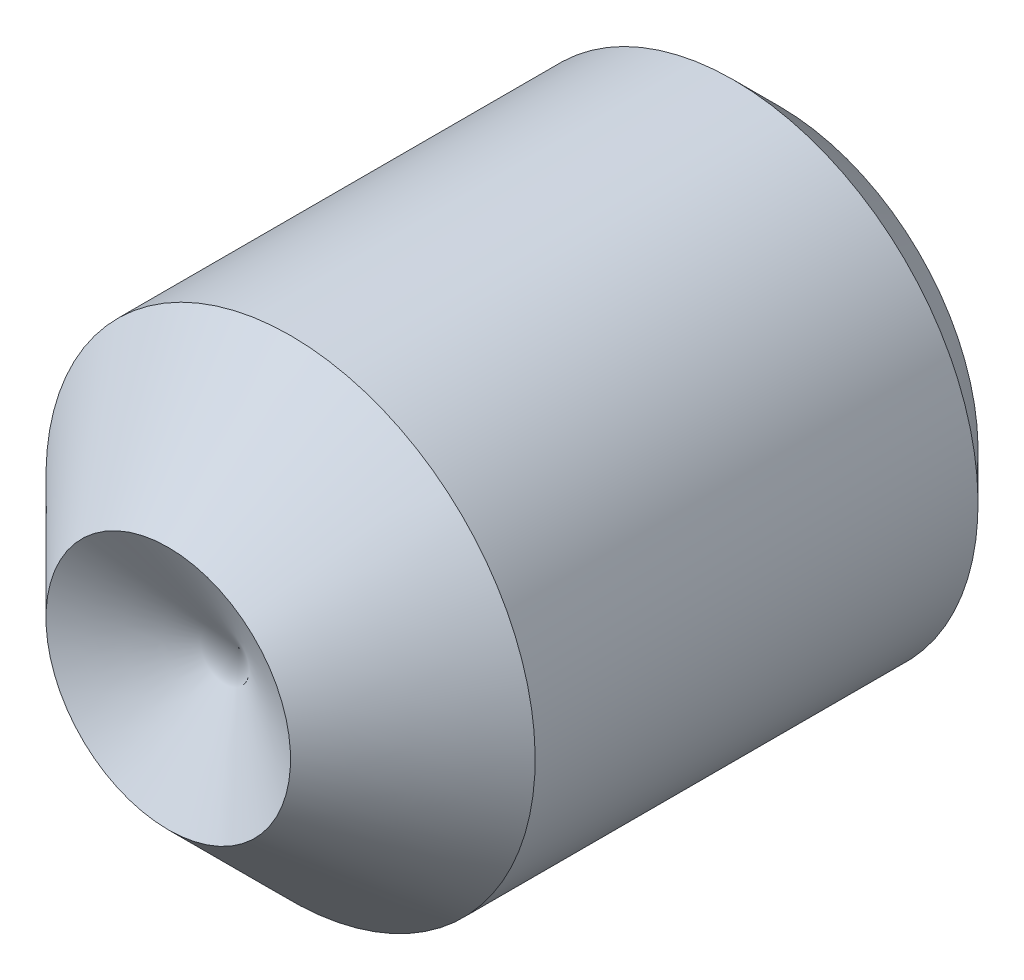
ISO-10303-21;
HEADER;
FILE_DESCRIPTION(('STEP AP214'),'2;1');
FILE_NAME('part.step','',(''),(''),'','','');
FILE_SCHEMA(('AUTOMOTIVE_DESIGN { 1 0 10303 214 1 1 1 1 }'));
ENDSEC;
DATA;
#1=APPLICATION_CONTEXT('core data for automotive mechanical design processes');
#2=APPLICATION_PROTOCOL_DEFINITION('international standard','automotive_design',2000,#1);
#3=PRODUCT_CONTEXT('',#1,'mechanical');
#4=PRODUCT('Part','Part','',(#3));
#5=PRODUCT_RELATED_PRODUCT_CATEGORY('part','',(#4));
#6=PRODUCT_DEFINITION_FORMATION('','',#4);
#7=PRODUCT_DEFINITION_CONTEXT('part definition',#1,'design');
#8=PRODUCT_DEFINITION('design','',#6,#7);
#9=PRODUCT_DEFINITION_SHAPE('','',#8);
#10=(LENGTH_UNIT() NAMED_UNIT(*) SI_UNIT(.MILLI.,.METRE.));
#11=(NAMED_UNIT(*) PLANE_ANGLE_UNIT() SI_UNIT($,.RADIAN.));
#12=(NAMED_UNIT(*) SI_UNIT($,.STERADIAN.) SOLID_ANGLE_UNIT());
#13=UNCERTAINTY_MEASURE_WITH_UNIT(LENGTH_MEASURE(1.E-05),#10,'distance_accuracy_value','');
#14=(GEOMETRIC_REPRESENTATION_CONTEXT(3) GLOBAL_UNCERTAINTY_ASSIGNED_CONTEXT((#13)) GLOBAL_UNIT_ASSIGNED_CONTEXT((#10,
#11,#12)) REPRESENTATION_CONTEXT('',''));
#15=CARTESIAN_POINT('',(0.,0.,0.));
#16=DIRECTION('',(0.,0.,1.));
#17=DIRECTION('',(1.,0.,0.));
#18=AXIS2_PLACEMENT_3D('',#15,#16,#17);
#19=CARTESIAN_POINT('',(0.,0.,4.71132486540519));
#20=DIRECTION('',(0.,0.,1.));
#21=DIRECTION('',(0.,1.,0.));
#22=AXIS2_PLACEMENT_3D('',#19,#20,#21);
#23=CONICAL_SURFACE('',#22,0.5,1.0471975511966);
#24=CARTESIAN_POINT('',(0.,0.,5.));
#25=DIRECTION('',(0.,0.,1.));
#26=DIRECTION('',(0.,1.,0.));
#27=AXIS2_PLACEMENT_3D('',#24,#25,#26);
#28=CIRCLE('',#27,1.);
#29=CARTESIAN_POINT('',(0.,1.,5.));
#30=VERTEX_POINT('',#29);
#31=EDGE_CURVE('E9',#30,#30,#28,.T.);
#32=ORIENTED_EDGE('',*,*,#31,.T.);
#33=EDGE_LOOP('',(#32));
#34=FACE_BOUND('',#33,.T.);
#35=CARTESIAN_POINT('',(0.,0.,4.42264973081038));
#36=VERTEX_POINT('',#35);
#37=VERTEX_LOOP('',#36);
#38=FACE_BOUND('',#37,.T.);
#39=ADVANCED_FACE('F15',(#34,#38),#23,.F.);
#40=CARTESIAN_POINT('',(0.,0.,4.5));
#41=DIRECTION('',(0.,0.,-1.));
#42=DIRECTION('',(0.,1.,0.));
#43=AXIS2_PLACEMENT_3D('',#40,#41,#42);
#44=CONICAL_SURFACE('',#43,1.5,0.785398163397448);
#45=CARTESIAN_POINT('',(0.,0.,4.));
#46=DIRECTION('',(0.,0.,1.));
#47=DIRECTION('',(0.,1.,0.));
#48=AXIS2_PLACEMENT_3D('',#45,#46,#47);
#49=CIRCLE('',#48,2.);
#50=CARTESIAN_POINT('',(0.,2.,4.));
#51=VERTEX_POINT('',#50);
#52=EDGE_CURVE('E25',#51,#51,#49,.T.);
#53=ORIENTED_EDGE('',*,*,#52,.T.);
#54=EDGE_LOOP('',(#53));
#55=FACE_BOUND('',#54,.T.);
#56=ORIENTED_EDGE('',*,*,#31,.F.);
#57=EDGE_LOOP('',(#56));
#58=FACE_BOUND('',#57,.T.);
#59=ADVANCED_FACE('F197',(#55,#58),#44,.T.);
#60=CARTESIAN_POINT('',(0.,0.,2.1894375));
#61=DIRECTION('',(0.,0.,-1.));
#62=DIRECTION('',(0.,1.,0.));
#63=AXIS2_PLACEMENT_3D('',#60,#61,#62);
#64=CYLINDRICAL_SURFACE('',#63,2.);
#65=CARTESIAN_POINT('',(0.,0.,0.378875));
#66=DIRECTION('',(0.,0.,1.));
#67=DIRECTION('',(0.,1.,0.));
#68=AXIS2_PLACEMENT_3D('',#65,#66,#67);
#69=CIRCLE('',#68,2.);
#70=CARTESIAN_POINT('',(0.,2.,0.378875));
#71=VERTEX_POINT('',#70);
#72=EDGE_CURVE('E136',#71,#71,#69,.T.);
#73=ORIENTED_EDGE('',*,*,#72,.T.);
#74=EDGE_LOOP('',(#73));
#75=FACE_BOUND('',#74,.T.);
#76=ORIENTED_EDGE('',*,*,#52,.F.);
#77=EDGE_LOOP('',(#76));
#78=FACE_BOUND('',#77,.T.);
#79=ADVANCED_FACE('F202',(#75,#78),#64,.T.);
#80=CARTESIAN_POINT('',(0.,0.,0.1894375));
#81=DIRECTION('',(0.,0.,1.));
#82=DIRECTION('',(0.,1.,0.));
#83=AXIS2_PLACEMENT_3D('',#80,#81,#82);
#84=CONICAL_SURFACE('',#83,1.8105625,0.785398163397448);
#85=CARTESIAN_POINT('',(0.,0.,0.));
#86=DIRECTION('',(0.,0.,1.));
#87=DIRECTION('',(0.,1.,0.));
#88=AXIS2_PLACEMENT_3D('',#85,#86,#87);
#89=CIRCLE('',#88,1.621125);
#90=CARTESIAN_POINT('',(0.,1.621125,0.));
#91=VERTEX_POINT('',#90);
#92=EDGE_CURVE('E85',#91,#91,#89,.T.);
#93=ORIENTED_EDGE('',*,*,#92,.T.);
#94=EDGE_LOOP('',(#93));
#95=FACE_BOUND('',#94,.T.);
#96=ORIENTED_EDGE('',*,*,#72,.F.);
#97=EDGE_LOOP('',(#96));
#98=FACE_BOUND('',#97,.T.);
#99=ADVANCED_FACE('F263',(#95,#98),#84,.T.);
#100=CARTESIAN_POINT('',(0.,0.8105625,0.));
#101=DIRECTION('',(0.,0.,-1.));
#102=DIRECTION('',(0.,-1.,0.));
#103=AXIS2_PLACEMENT_3D('',#100,#101,#102);
#104=PLANE('',#103);
#105=ORIENTED_EDGE('',*,*,#92,.F.);
#106=EDGE_LOOP('',(#105));
#107=FACE_BOUND('',#106,.T.);
#108=DIRECTION('',(0.5,0.866025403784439,0.));
#109=VECTOR('',#108,1.);
#110=CARTESIAN_POINT('',(1.04151692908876,-0.196038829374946,0.));
#111=LINE('',#110,#109);
#112=CARTESIAN_POINT('',(0.57735,-0.999999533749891,0.));
#113=VERTEX_POINT('',#112);
#114=CARTESIAN_POINT('',(1.1547,0.,0.));
#115=VERTEX_POINT('',#114);
#116=EDGE_CURVE('E133',#113,#115,#111,.T.);
#117=ORIENTED_EDGE('',*,*,#116,.T.);
#118=DIRECTION('',(-0.5,0.866025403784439,0.));
#119=VECTOR('',#118,1.);
#120=CARTESIAN_POINT('',(0.690533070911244,0.803960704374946,0.));
#121=LINE('',#120,#119);
#122=CARTESIAN_POINT('',(0.57735,0.999999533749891,0.));
#123=VERTEX_POINT('',#122);
#124=EDGE_CURVE('E93',#115,#123,#121,.T.);
#125=ORIENTED_EDGE('',*,*,#124,.T.);
#126=DIRECTION('',(-1.,0.,0.));
#127=VECTOR('',#126,1.);
#128=CARTESIAN_POINT('',(0.,0.999999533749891,0.));
#129=LINE('',#128,#127);
#130=CARTESIAN_POINT('',(-0.57735,0.999999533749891,0.));
#131=VERTEX_POINT('',#130);
#132=EDGE_CURVE('E19',#123,#131,#129,.T.);
#133=ORIENTED_EDGE('',*,*,#132,.T.);
#134=DIRECTION('',(-0.5,-0.866025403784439,0.));
#135=VECTOR('',#134,1.);
#136=CARTESIAN_POINT('',(-0.690533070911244,0.803960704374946,0.));
#137=LINE('',#136,#135);
#138=CARTESIAN_POINT('',(-1.1547,0.,0.));
#139=VERTEX_POINT('',#138);
#140=EDGE_CURVE('E156',#131,#139,#137,.T.);
#141=ORIENTED_EDGE('',*,*,#140,.T.);
#142=DIRECTION('',(0.5,-0.866025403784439,0.));
#143=VECTOR('',#142,1.);
#144=CARTESIAN_POINT('',(-1.04151692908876,-0.196038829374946,0.));
#145=LINE('',#144,#143);
#146=CARTESIAN_POINT('',(-0.57735,-0.999999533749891,0.));
#147=VERTEX_POINT('',#146);
#148=EDGE_CURVE('E151',#139,#147,#145,.T.);
#149=ORIENTED_EDGE('',*,*,#148,.T.);
#150=DIRECTION('',(1.,0.,0.));
#151=VECTOR('',#150,1.);
#152=CARTESIAN_POINT('',(0.,-0.999999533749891,0.));
#153=LINE('',#152,#151);
#154=EDGE_CURVE('E125',#147,#113,#153,.T.);
#155=ORIENTED_EDGE('',*,*,#154,.T.);
#156=EDGE_LOOP('',(#117,#125,#133,#141,#149,#155));
#157=FACE_BOUND('',#156,.T.);
#158=ADVANCED_FACE('F176',(#107,#157),#104,.T.);
#159=CARTESIAN_POINT('',(0.866025,0.499999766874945,0.));
#160=DIRECTION('',(0.866025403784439,0.5,0.));
#161=DIRECTION('',(-0.5,0.866025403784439,0.));
#162=AXIS2_PLACEMENT_3D('',#159,#160,#161);
#163=PLANE('',#162);
#164=CARTESIAN_POINT('',(1.1547,0.,1.5));
#165=CARTESIAN_POINT('',(0.866025,0.499999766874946,1.66666658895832));
#166=CARTESIAN_POINT('',(0.57735,0.999999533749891,1.5));
#167=(BOUNDED_CURVE() B_SPLINE_CURVE(2,(#164,#165,#166),.UNSPECIFIED.,.F.,
.F.) B_SPLINE_CURVE_WITH_KNOTS((3,3),(0.,1.16843559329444),
.UNSPECIFIED.) CURVE() GEOMETRIC_REPRESENTATION_ITEM() RATIONAL_B_SPLINE_CURVE((1.,
1.15470053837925,1.)) REPRESENTATION_ITEM(''));
#168=CARTESIAN_POINT('',(1.1547,0.,1.5));
#169=VERTEX_POINT('',#168);
#170=CARTESIAN_POINT('',(0.57735,0.999999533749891,1.5));
#171=VERTEX_POINT('',#170);
#172=EDGE_CURVE('E116',#169,#171,#167,.T.);
#173=ORIENTED_EDGE('',*,*,#172,.T.);
#174=DIRECTION('',(0.,0.,1.));
#175=VECTOR('',#174,1.);
#176=CARTESIAN_POINT('',(0.57735,0.999999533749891,0.));
#177=LINE('',#176,#175);
#178=EDGE_CURVE('E62',#123,#171,#177,.T.);
#179=ORIENTED_EDGE('',*,*,#178,.F.);
#180=ORIENTED_EDGE('',*,*,#124,.F.);
#181=DIRECTION('',(0.,0.,1.));
#182=VECTOR('',#181,1.);
#183=CARTESIAN_POINT('',(1.1547,0.,0.));
#184=LINE('',#183,#182);
#185=EDGE_CURVE('E54',#115,#169,#184,.T.);
#186=ORIENTED_EDGE('',*,*,#185,.T.);
#187=EDGE_LOOP('',(#173,#179,#180,#186));
#188=FACE_BOUND('',#187,.T.);
#189=ADVANCED_FACE('F17',(#188),#163,.F.);
#190=CARTESIAN_POINT('',(0.,0.999999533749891,0.));
#191=DIRECTION('',(0.,1.,0.));
#192=DIRECTION('',(-1.,0.,0.));
#193=AXIS2_PLACEMENT_3D('',#190,#191,#192);
#194=PLANE('',#193);
#195=CARTESIAN_POINT('',(0.57735,0.999999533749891,1.5));
#196=CARTESIAN_POINT('',(0.,0.999999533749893,1.66666658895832));
#197=CARTESIAN_POINT('',(-0.57735,0.999999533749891,1.5));
#198=(BOUNDED_CURVE() B_SPLINE_CURVE(2,(#195,#196,#197),.UNSPECIFIED.,.F.,
.F.) B_SPLINE_CURVE_WITH_KNOTS((3,3),(0.,1.16843559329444),
.UNSPECIFIED.) CURVE() GEOMETRIC_REPRESENTATION_ITEM() RATIONAL_B_SPLINE_CURVE((1.,
1.15470053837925,1.)) REPRESENTATION_ITEM(''));
#199=CARTESIAN_POINT('',(-0.57735,0.999999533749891,1.5));
#200=VERTEX_POINT('',#199);
#201=EDGE_CURVE('E111',#171,#200,#198,.T.);
#202=ORIENTED_EDGE('',*,*,#201,.T.);
#203=DIRECTION('',(0.,0.,1.));
#204=VECTOR('',#203,1.);
#205=CARTESIAN_POINT('',(-0.57735,0.999999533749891,0.));
#206=LINE('',#205,#204);
#207=EDGE_CURVE('E155',#131,#200,#206,.T.);
#208=ORIENTED_EDGE('',*,*,#207,.F.);
#209=ORIENTED_EDGE('',*,*,#132,.F.);
#210=ORIENTED_EDGE('',*,*,#178,.T.);
#211=EDGE_LOOP('',(#202,#208,#209,#210));
#212=FACE_BOUND('',#211,.T.);
#213=ADVANCED_FACE('F171',(#212),#194,.F.);
#214=CARTESIAN_POINT('',(-0.866025,0.499999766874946,0.));
#215=DIRECTION('',(-0.866025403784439,0.5,0.));
#216=DIRECTION('',(-0.5,-0.866025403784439,0.));
#217=AXIS2_PLACEMENT_3D('',#214,#215,#216);
#218=PLANE('',#217);
#219=CARTESIAN_POINT('',(-0.57735,0.999999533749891,1.5));
#220=CARTESIAN_POINT('',(-0.866025,0.499999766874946,1.66666658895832));
#221=CARTESIAN_POINT('',(-1.1547,0.,1.5));
#222=(BOUNDED_CURVE() B_SPLINE_CURVE(2,(#219,#220,#221),.UNSPECIFIED.,.F.,
.F.) B_SPLINE_CURVE_WITH_KNOTS((3,3),(0.,1.16843559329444),
.UNSPECIFIED.) CURVE() GEOMETRIC_REPRESENTATION_ITEM() RATIONAL_B_SPLINE_CURVE((1.,
1.15470053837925,1.)) REPRESENTATION_ITEM(''));
#223=CARTESIAN_POINT('',(-1.1547,0.,1.5));
#224=VERTEX_POINT('',#223);
#225=EDGE_CURVE('E109',#200,#224,#222,.T.);
#226=ORIENTED_EDGE('',*,*,#225,.T.);
#227=DIRECTION('',(0.,0.,1.));
#228=VECTOR('',#227,1.);
#229=CARTESIAN_POINT('',(-1.1547,0.,0.));
#230=LINE('',#229,#228);
#231=EDGE_CURVE('E70',#139,#224,#230,.T.);
#232=ORIENTED_EDGE('',*,*,#231,.F.);
#233=ORIENTED_EDGE('',*,*,#140,.F.);
#234=ORIENTED_EDGE('',*,*,#207,.T.);
#235=EDGE_LOOP('',(#226,#232,#233,#234));
#236=FACE_BOUND('',#235,.T.);
#237=ADVANCED_FACE('F172',(#236),#218,.F.);
#238=CARTESIAN_POINT('',(-0.866025,-0.499999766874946,0.));
#239=DIRECTION('',(-0.866025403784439,-0.5,0.));
#240=DIRECTION('',(0.5,-0.866025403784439,0.));
#241=AXIS2_PLACEMENT_3D('',#238,#239,#240);
#242=PLANE('',#241);
#243=CARTESIAN_POINT('',(-1.1547,0.,1.5));
#244=CARTESIAN_POINT('',(-0.866025,-0.499999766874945,1.66666658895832));
#245=CARTESIAN_POINT('',(-0.57735,-0.999999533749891,1.5));
#246=(BOUNDED_CURVE() B_SPLINE_CURVE(2,(#243,#244,#245),.UNSPECIFIED.,.F.,
.F.) B_SPLINE_CURVE_WITH_KNOTS((3,3),(0.,1.16843559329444),
.UNSPECIFIED.) CURVE() GEOMETRIC_REPRESENTATION_ITEM() RATIONAL_B_SPLINE_CURVE((1.,
1.15470053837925,1.)) REPRESENTATION_ITEM(''));
#247=CARTESIAN_POINT('',(-0.57735,-0.999999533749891,1.5));
#248=VERTEX_POINT('',#247);
#249=EDGE_CURVE('E113',#224,#248,#246,.T.);
#250=ORIENTED_EDGE('',*,*,#249,.T.);
#251=DIRECTION('',(0.,0.,1.));
#252=VECTOR('',#251,1.);
#253=CARTESIAN_POINT('',(-0.57735,-0.999999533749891,0.));
#254=LINE('',#253,#252);
#255=EDGE_CURVE('E131',#147,#248,#254,.T.);
#256=ORIENTED_EDGE('',*,*,#255,.F.);
#257=ORIENTED_EDGE('',*,*,#148,.F.);
#258=ORIENTED_EDGE('',*,*,#231,.T.);
#259=EDGE_LOOP('',(#250,#256,#257,#258));
#260=FACE_BOUND('',#259,.T.);
#261=ADVANCED_FACE('F174',(#260),#242,.F.);
#262=CARTESIAN_POINT('',(0.,-0.999999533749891,0.));
#263=DIRECTION('',(0.,-1.,0.));
#264=DIRECTION('',(1.,0.,0.));
#265=AXIS2_PLACEMENT_3D('',#262,#263,#264);
#266=PLANE('',#265);
#267=CARTESIAN_POINT('',(-0.57735,-0.999999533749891,1.5));
#268=CARTESIAN_POINT('',(0.,-0.999999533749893,1.66666658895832));
#269=CARTESIAN_POINT('',(0.57735,-0.999999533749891,1.5));
#270=(BOUNDED_CURVE() B_SPLINE_CURVE(2,(#267,#268,#269),.UNSPECIFIED.,.F.,
.F.) B_SPLINE_CURVE_WITH_KNOTS((3,3),(0.,1.16843559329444),
.UNSPECIFIED.) CURVE() GEOMETRIC_REPRESENTATION_ITEM() RATIONAL_B_SPLINE_CURVE((1.,
1.15470053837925,1.)) REPRESENTATION_ITEM(''));
#271=CARTESIAN_POINT('',(0.57735,-0.999999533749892,1.5));
#272=VERTEX_POINT('',#271);
#273=EDGE_CURVE('E143',#248,#272,#270,.T.);
#274=ORIENTED_EDGE('',*,*,#273,.T.);
#275=DIRECTION('',(0.,0.,1.));
#276=VECTOR('',#275,1.);
#277=CARTESIAN_POINT('',(0.57735,-0.999999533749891,0.));
#278=LINE('',#277,#276);
#279=EDGE_CURVE('E132',#113,#272,#278,.T.);
#280=ORIENTED_EDGE('',*,*,#279,.F.);
#281=ORIENTED_EDGE('',*,*,#154,.F.);
#282=ORIENTED_EDGE('',*,*,#255,.T.);
#283=EDGE_LOOP('',(#274,#280,#281,#282));
#284=FACE_BOUND('',#283,.T.);
#285=ADVANCED_FACE('F178',(#284),#266,.F.);
#286=CARTESIAN_POINT('',(0.866025,-0.499999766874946,0.));
#287=DIRECTION('',(0.866025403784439,-0.5,0.));
#288=DIRECTION('',(0.5,0.866025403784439,0.));
#289=AXIS2_PLACEMENT_3D('',#286,#287,#288);
#290=PLANE('',#289);
#291=CARTESIAN_POINT('',(0.57735,-0.999999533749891,1.5));
#292=CARTESIAN_POINT('',(0.866025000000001,-0.499999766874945,1.66666658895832));
#293=CARTESIAN_POINT('',(1.1547,0.,1.5));
#294=(BOUNDED_CURVE() B_SPLINE_CURVE(2,(#291,#292,#293),.UNSPECIFIED.,.F.,
.F.) B_SPLINE_CURVE_WITH_KNOTS((3,3),(0.,1.16843559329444),
.UNSPECIFIED.) CURVE() GEOMETRIC_REPRESENTATION_ITEM() RATIONAL_B_SPLINE_CURVE((1.,
1.15470053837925,1.)) REPRESENTATION_ITEM(''));
#295=EDGE_CURVE('E142',#272,#169,#294,.T.);
#296=ORIENTED_EDGE('',*,*,#295,.T.);
#297=ORIENTED_EDGE('',*,*,#185,.F.);
#298=ORIENTED_EDGE('',*,*,#116,.F.);
#299=ORIENTED_EDGE('',*,*,#279,.T.);
#300=EDGE_LOOP('',(#296,#297,#298,#299));
#301=FACE_BOUND('',#300,.T.);
#302=ADVANCED_FACE('F104',(#301),#290,.F.);
#303=CARTESIAN_POINT('',(0.,0.,1.83333317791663));
#304=DIRECTION('',(0.,0.,-1.));
#305=DIRECTION('',(0.,1.,0.));
#306=AXIS2_PLACEMENT_3D('',#303,#304,#305);
#307=CONICAL_SURFACE('',#306,0.57735,1.0471975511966);
#308=CARTESIAN_POINT('',(0.,0.,2.16666635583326));
#309=VERTEX_POINT('',#308);
#310=VERTEX_LOOP('',#309);
#311=FACE_BOUND('',#310,.T.);
#312=ORIENTED_EDGE('',*,*,#225,.F.);
#313=ORIENTED_EDGE('',*,*,#201,.F.);
#314=ORIENTED_EDGE('',*,*,#172,.F.);
#315=ORIENTED_EDGE('',*,*,#295,.F.);
#316=ORIENTED_EDGE('',*,*,#273,.F.);
#317=ORIENTED_EDGE('',*,*,#249,.F.);
#318=EDGE_LOOP('',(#312,#313,#314,#315,#316,#317));
#319=FACE_BOUND('',#318,.T.);
#320=ADVANCED_FACE('F101',(#311,#319),#307,.F.);
#321=CLOSED_SHELL('',(#39,#59,#79,#99,#158,#189,#213,#237,#261,#285,#302,#320));
#322=MANIFOLD_SOLID_BREP('B1',#321);
#323=ADVANCED_BREP_SHAPE_REPRESENTATION('',(#18,#322),#14);
#324=SHAPE_DEFINITION_REPRESENTATION(#9,#323);
ENDSEC;
END-ISO-10303-21;
